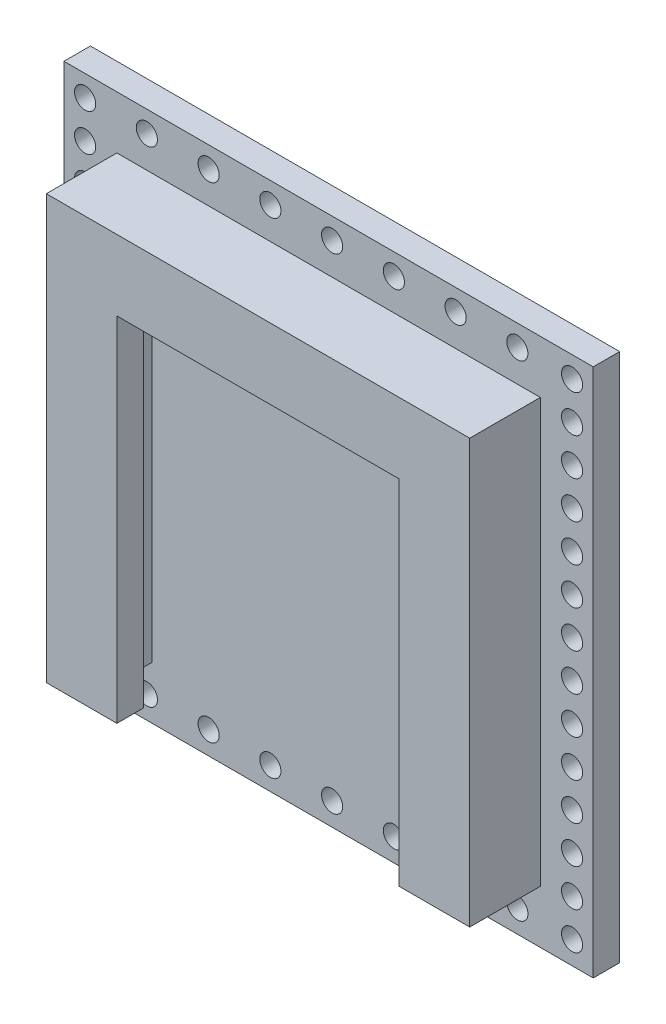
from build123d import *

# Parameters (mm, degrees)
BOSS_EXTRUDE1_DEPTH      = 1
BOSS_EXTRUDE1_DEPTH_BACK = 0.5
SKETCH1_W                = 30
SKETCH1_H                = 30
SKETCH2_R                = 0.6
CUT_EXTRUDE1_DEPTH       = 9
BOSS_EXTRUDE2_DEPTH      = 4
SKETCH4_W                = 20
SKETCH4_H                = 2.5
CUT_EXTRUDE2_DEPTH       = 20


with BuildPart() as part:
    # Sketch1 → Boss-Extrude1 (new, two sides: drawn at the far end of the back side and taken through both)
    with BuildSketch(Plane.XY.offset(-BOSS_EXTRUDE1_DEPTH_BACK)):
        Rectangle(SKETCH1_W, SKETCH1_H)
    extrude(amount=BOSS_EXTRUDE1_DEPTH + BOSS_EXTRUDE1_DEPTH_BACK)

    # Sketch2 → Cut-Extrude1 (cut)
    with BuildSketch(Plane.XY.offset(1)):
        with Locations((-13.8, 13.8)):
            Circle(SKETCH2_R)
        with Locations((-13.8, 11.684615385)):
            Circle(SKETCH2_R)
        with Locations((-13.8, 9.569230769)):
            Circle(SKETCH2_R)
        with Locations((-13.8, 7.453846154)):
            Circle(SKETCH2_R)
        with Locations((-13.8, 5.338461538)):
            Circle(SKETCH2_R)
        with Locations((-13.8, 3.223076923)):
            Circle(SKETCH2_R)
        with Locations((-13.8, 1.107692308)):
            Circle(SKETCH2_R)
        with Locations((-13.8, -1.007692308)):
            Circle(SKETCH2_R)
        with Locations((-13.8, -3.123076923)):
            Circle(SKETCH2_R)
        with Locations((-13.8, -5.238461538)):
            Circle(SKETCH2_R)
        with Locations((-13.8, -7.353846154)):
            Circle(SKETCH2_R)
        with Locations((-13.8, -9.469230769)):
            Circle(SKETCH2_R)
        with Locations((-13.8, -11.584615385)):
            Circle(SKETCH2_R)
        with Locations((-13.8, -13.7)):
            Circle(SKETCH2_R)
        with Locations((13.8, 13.8)):
            Circle(SKETCH2_R)
        with Locations((13.8, 11.684615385)):
            Circle(SKETCH2_R)
        with Locations((13.8, 9.569230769)):
            Circle(SKETCH2_R)
        with Locations((13.8, 7.453846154)):
            Circle(SKETCH2_R)
        with Locations((13.8, 5.338461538)):
            Circle(SKETCH2_R)
        with Locations((13.8, 3.223076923)):
            Circle(SKETCH2_R)
        with Locations((13.8, 1.107692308)):
            Circle(SKETCH2_R)
        with Locations((13.8, -1.007692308)):
            Circle(SKETCH2_R)
        with Locations((13.8, -3.123076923)):
            Circle(SKETCH2_R)
        with Locations((13.8, -5.238461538)):
            Circle(SKETCH2_R)
        with Locations((13.8, -7.353846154)):
            Circle(SKETCH2_R)
        with Locations((13.8, -9.469230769)):
            Circle(SKETCH2_R)
        with Locations((13.8, -11.584615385)):
            Circle(SKETCH2_R)
        with Locations((13.8, -13.7)):
            Circle(SKETCH2_R)
        with Locations((-10.3, 13.8)):
            Circle(SKETCH2_R)
        with Locations((-6.8, 13.8)):
            Circle(SKETCH2_R)
        with Locations((-3.3, 13.8)):
            Circle(SKETCH2_R)
        with Locations((0.2, 13.8)):
            Circle(SKETCH2_R)
        with Locations((3.7, 13.8)):
            Circle(SKETCH2_R)
        with Locations((7.2, 13.8)):
            Circle(SKETCH2_R)
        with Locations((10.7, 13.8)):
            Circle(SKETCH2_R)
        with Locations((-10.3, -13.7)):
            Circle(SKETCH2_R)
        with Locations((-6.8, -13.7)):
            Circle(SKETCH2_R)
        with Locations((-3.3, -13.7)):
            Circle(SKETCH2_R)
        with Locations((0.2, -13.7)):
            Circle(SKETCH2_R)
        with Locations((3.7, -13.7)):
            Circle(SKETCH2_R)
        with Locations((7.2, -13.7)):
            Circle(SKETCH2_R)
        with Locations((10.7, -13.7)):
            Circle(SKETCH2_R)
    extrude(amount=-CUT_EXTRUDE1_DEPTH, mode=Mode.SUBTRACT)

    # Sketch3 → Boss-Extrude2 (add)
    with BuildSketch(Plane.XY.offset(1)):
        Polygon((-8, -12), (-8, 8), (8, 8), (8, -12), (12, -12), (12, 12), (-12, 12), (-12, -12), align=None)
    extrude(amount=BOSS_EXTRUDE2_DEPTH)

    # Sketch4 → Cut-Extrude2 (cut)
    with BuildSketch(Plane.XZ.offset(12)):
        with Locations((0, 2.25)):
            Rectangle(SKETCH4_W, SKETCH4_H)
    extrude(amount=-CUT_EXTRUDE2_DEPTH, mode=Mode.SUBTRACT)


solid = part.part
